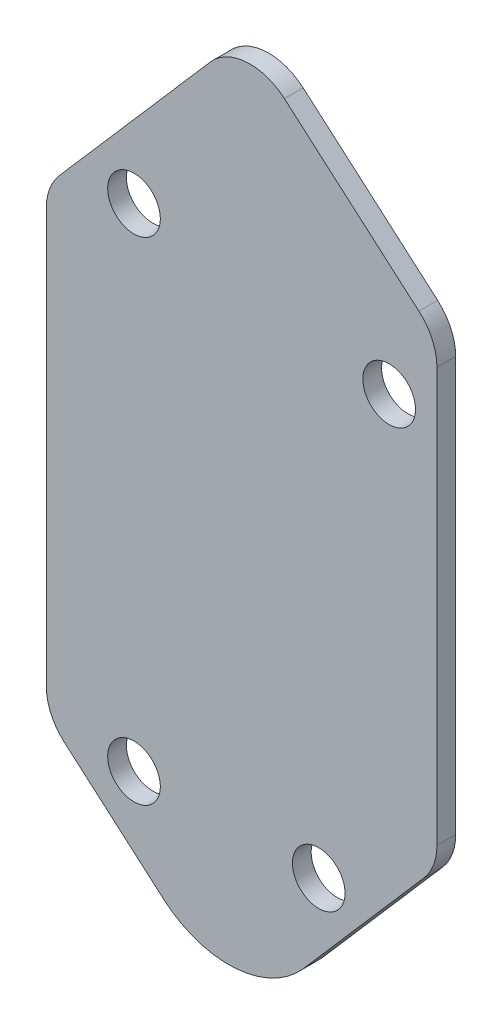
from build123d import *

# Parameters (mm, degrees)
BOSS_EXTRUDE1_DEPTH = 2.54
HOLE1_D             = 7.1374


with BuildPart() as part:
    # Sketch2 → Boss-Extrude1 (new body)
    with BuildSketch(Plane(origin=(0, 0, 82.1182), x_dir=(-1, 0, 0), z_dir=(0, 0, -1))):
        with BuildLine():
            Line((778.093225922, -55.416758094), (794.432843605, -74.23190053))
            ThreePointArc((794.432843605, -74.23190053), (803.651434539, -78.833746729), (813.423959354, -75.56921522))
            Line((813.423959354, -75.56921522), (826.861268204, -63.899864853))
            ThreePointArc((826.861268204, -63.899864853), (828.668923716, -61.480970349), (829.31, -58.530090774))
            Line((829.31, -58.530090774), (829.31, -2.38626948))
            ThreePointArc((829.31, -2.38626948), (828.860220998, 0.102777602), (827.567774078, 2.276998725))
            Line((827.567774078, 2.276998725), (807.06452407, 25.886582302))
            ThreePointArc((807.06452407, 25.886582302), (802.194325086, 28.317746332), (797.031481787, 26.593088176))
            Line((797.031481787, 26.593088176), (778.799731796, 10.760105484))
            ThreePointArc((778.799731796, 10.760105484), (776.992076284, 8.34121098), (776.351, 5.390331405))
            Line((776.351, 5.390331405), (776.351, -50.753489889))
            ThreePointArc((776.351, -50.753489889), (776.800779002, -53.242536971), (778.093225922, -55.416758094))
        make_face()
    extrude(amount=-BOSS_EXTRUDE1_DEPTH)

    # Hole1 (through all)
    with Locations(Plane(origin=(-779.173739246, 9.59945478, 82.1182), x_dir=(-1, 0, 0), z_dir=(0, 0, -1))):
        with Locations((3.654260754, -10.601140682), (38.251254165, -5.521140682), (13.204422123, -72.196140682), (38.251254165, -72.196140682)):
            Hole(HOLE1_D / 2)


solid = part.part
